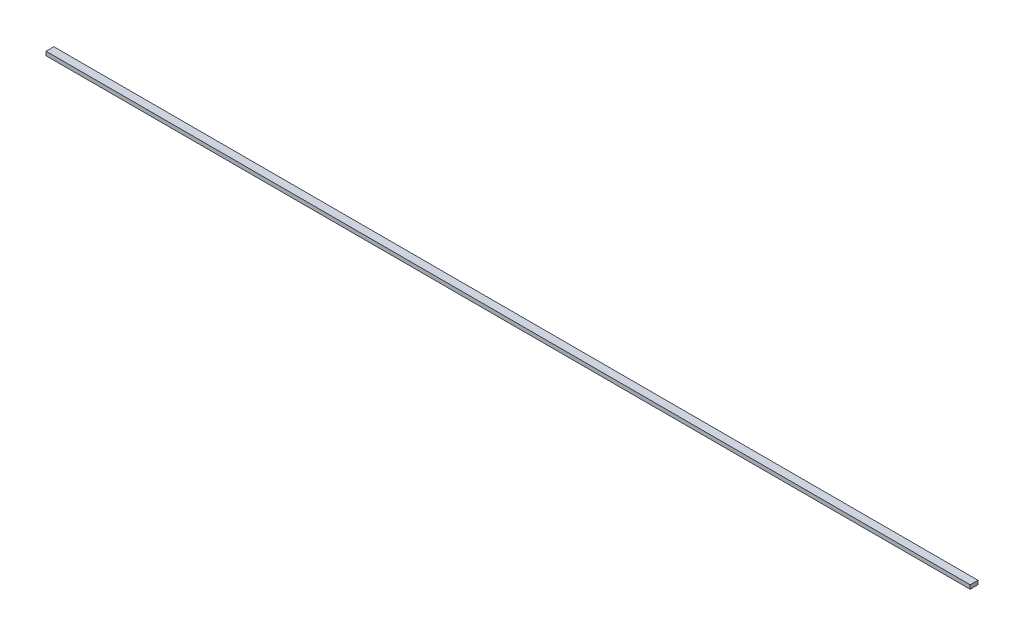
ISO-10303-21;
HEADER;
FILE_DESCRIPTION(('STEP AP214'),'2;1');
FILE_NAME('part.step','',(''),(''),'','','');
FILE_SCHEMA(('AUTOMOTIVE_DESIGN { 1 0 10303 214 1 1 1 1 }'));
ENDSEC;
DATA;
#1=APPLICATION_CONTEXT('core data for automotive mechanical design processes');
#2=APPLICATION_PROTOCOL_DEFINITION('international standard','automotive_design',2000,#1);
#3=PRODUCT_CONTEXT('',#1,'mechanical');
#4=PRODUCT('Part','Part','',(#3));
#5=PRODUCT_RELATED_PRODUCT_CATEGORY('part','',(#4));
#6=PRODUCT_DEFINITION_FORMATION('','',#4);
#7=PRODUCT_DEFINITION_CONTEXT('part definition',#1,'design');
#8=PRODUCT_DEFINITION('design','',#6,#7);
#9=PRODUCT_DEFINITION_SHAPE('','',#8);
#10=(LENGTH_UNIT() NAMED_UNIT(*) SI_UNIT(.MILLI.,.METRE.));
#11=(NAMED_UNIT(*) PLANE_ANGLE_UNIT() SI_UNIT($,.RADIAN.));
#12=(NAMED_UNIT(*) SI_UNIT($,.STERADIAN.) SOLID_ANGLE_UNIT());
#13=UNCERTAINTY_MEASURE_WITH_UNIT(LENGTH_MEASURE(1.E-05),#10,'distance_accuracy_value','');
#14=(GEOMETRIC_REPRESENTATION_CONTEXT(3) GLOBAL_UNCERTAINTY_ASSIGNED_CONTEXT((#13)) GLOBAL_UNIT_ASSIGNED_CONTEXT((#10,
#11,#12)) REPRESENTATION_CONTEXT('',''));
#15=CARTESIAN_POINT('',(0.,0.,0.));
#16=DIRECTION('',(0.,0.,1.));
#17=DIRECTION('',(1.,0.,0.));
#18=AXIS2_PLACEMENT_3D('',#15,#16,#17);
#19=CARTESIAN_POINT('',(-90.3330492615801,12.7,-18.5451955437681));
#20=DIRECTION('',(1.,0.,0.));
#21=DIRECTION('',(0.,0.,-1.));
#22=AXIS2_PLACEMENT_3D('',#19,#20,#21);
#23=PLANE('',#22);
#24=DIRECTION('',(0.,0.,1.));
#25=VECTOR('',#24,1.);
#26=CARTESIAN_POINT('',(-90.3330492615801,0.,-18.5451955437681));
#27=LINE('',#26,#25);
#28=CARTESIAN_POINT('',(-90.3330492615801,0.,-43.9451955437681));
#29=VERTEX_POINT('',#28);
#30=CARTESIAN_POINT('',(-90.3330492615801,0.,-18.5451955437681));
#31=VERTEX_POINT('',#30);
#32=EDGE_CURVE('E96',#29,#31,#27,.T.);
#33=ORIENTED_EDGE('',*,*,#32,.T.);
#34=DIRECTION('',(0.,-1.,0.));
#35=VECTOR('',#34,1.);
#36=CARTESIAN_POINT('',(-90.3330492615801,12.7,-18.5451955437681));
#37=LINE('',#36,#35);
#38=CARTESIAN_POINT('',(-90.3330492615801,12.7,-18.5451955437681));
#39=VERTEX_POINT('',#38);
#40=EDGE_CURVE('E11',#39,#31,#37,.T.);
#41=ORIENTED_EDGE('',*,*,#40,.F.);
#42=DIRECTION('',(0.,0.,1.));
#43=VECTOR('',#42,1.);
#44=CARTESIAN_POINT('',(-90.3330492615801,12.7,-18.5451955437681));
#45=LINE('',#44,#43);
#46=CARTESIAN_POINT('',(-90.3330492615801,12.7,-43.9451955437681));
#47=VERTEX_POINT('',#46);
#48=EDGE_CURVE('E84',#47,#39,#45,.T.);
#49=ORIENTED_EDGE('',*,*,#48,.F.);
#50=DIRECTION('',(0.,-1.,0.));
#51=VECTOR('',#50,1.);
#52=CARTESIAN_POINT('',(-90.3330492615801,12.7,-43.9451955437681));
#53=LINE('',#52,#51);
#54=EDGE_CURVE('E92',#47,#29,#53,.T.);
#55=ORIENTED_EDGE('',*,*,#54,.T.);
#56=EDGE_LOOP('',(#33,#41,#49,#55));
#57=FACE_BOUND('',#56,.T.);
#58=ADVANCED_FACE('F33',(#57),#23,.F.);
#59=CARTESIAN_POINT('',(-90.3330492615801,12.7,-18.5451955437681));
#60=DIRECTION('',(0.,0.,-1.));
#61=DIRECTION('',(-1.,0.,0.));
#62=AXIS2_PLACEMENT_3D('',#59,#60,#61);
#63=PLANE('',#62);
#64=DIRECTION('',(1.,0.,0.));
#65=VECTOR('',#64,1.);
#66=CARTESIAN_POINT('',(-90.3330492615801,0.,-18.5451955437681));
#67=LINE('',#66,#65);
#68=CARTESIAN_POINT('',(2906.86695073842,0.,-18.5451955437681));
#69=VERTEX_POINT('',#68);
#70=EDGE_CURVE('E88',#31,#69,#67,.T.);
#71=ORIENTED_EDGE('',*,*,#70,.T.);
#72=DIRECTION('',(0.,-1.,0.));
#73=VECTOR('',#72,1.);
#74=CARTESIAN_POINT('',(2906.86695073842,12.7,-18.5451955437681));
#75=LINE('',#74,#73);
#76=CARTESIAN_POINT('',(2906.86695073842,12.7,-18.5451955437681));
#77=VERTEX_POINT('',#76);
#78=EDGE_CURVE('E41',#77,#69,#75,.T.);
#79=ORIENTED_EDGE('',*,*,#78,.F.);
#80=DIRECTION('',(1.,0.,0.));
#81=VECTOR('',#80,1.);
#82=CARTESIAN_POINT('',(-90.3330492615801,12.7,-18.5451955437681));
#83=LINE('',#82,#81);
#84=EDGE_CURVE('E79',#39,#77,#83,.T.);
#85=ORIENTED_EDGE('',*,*,#84,.F.);
#86=ORIENTED_EDGE('',*,*,#40,.T.);
#87=EDGE_LOOP('',(#71,#79,#85,#86));
#88=FACE_BOUND('',#87,.T.);
#89=ADVANCED_FACE('F87',(#88),#63,.F.);
#90=CARTESIAN_POINT('',(2906.86695073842,12.7,-18.5451955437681));
#91=DIRECTION('',(-1.,0.,0.));
#92=DIRECTION('',(0.,0.,1.));
#93=AXIS2_PLACEMENT_3D('',#90,#91,#92);
#94=PLANE('',#93);
#95=DIRECTION('',(0.,0.,-1.));
#96=VECTOR('',#95,1.);
#97=CARTESIAN_POINT('',(2906.86695073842,0.,-18.5451955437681));
#98=LINE('',#97,#96);
#99=CARTESIAN_POINT('',(2906.86695073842,0.,-43.9451955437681));
#100=VERTEX_POINT('',#99);
#101=EDGE_CURVE('E66',#69,#100,#98,.T.);
#102=ORIENTED_EDGE('',*,*,#101,.T.);
#103=DIRECTION('',(0.,-1.,0.));
#104=VECTOR('',#103,1.);
#105=CARTESIAN_POINT('',(2906.86695073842,12.7,-43.9451955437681));
#106=LINE('',#105,#104);
#107=CARTESIAN_POINT('',(2906.86695073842,12.7,-43.9451955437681));
#108=VERTEX_POINT('',#107);
#109=EDGE_CURVE('E89',#108,#100,#106,.T.);
#110=ORIENTED_EDGE('',*,*,#109,.F.);
#111=DIRECTION('',(0.,0.,-1.));
#112=VECTOR('',#111,1.);
#113=CARTESIAN_POINT('',(2906.86695073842,12.7,-18.5451955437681));
#114=LINE('',#113,#112);
#115=EDGE_CURVE('E82',#77,#108,#114,.T.);
#116=ORIENTED_EDGE('',*,*,#115,.F.);
#117=ORIENTED_EDGE('',*,*,#78,.T.);
#118=EDGE_LOOP('',(#102,#110,#116,#117));
#119=FACE_BOUND('',#118,.T.);
#120=ADVANCED_FACE('F90',(#119),#94,.F.);
#121=CARTESIAN_POINT('',(-90.3330492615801,12.7,-43.9451955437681));
#122=DIRECTION('',(0.,0.,1.));
#123=DIRECTION('',(1.,0.,0.));
#124=AXIS2_PLACEMENT_3D('',#121,#122,#123);
#125=PLANE('',#124);
#126=DIRECTION('',(-1.,0.,0.));
#127=VECTOR('',#126,1.);
#128=CARTESIAN_POINT('',(-90.3330492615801,0.,-43.9451955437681));
#129=LINE('',#128,#127);
#130=EDGE_CURVE('E72',#100,#29,#129,.T.);
#131=ORIENTED_EDGE('',*,*,#130,.T.);
#132=ORIENTED_EDGE('',*,*,#54,.F.);
#133=DIRECTION('',(-1.,0.,0.));
#134=VECTOR('',#133,1.);
#135=CARTESIAN_POINT('',(-90.3330492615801,12.7,-43.9451955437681));
#136=LINE('',#135,#134);
#137=EDGE_CURVE('E49',#108,#47,#136,.T.);
#138=ORIENTED_EDGE('',*,*,#137,.F.);
#139=ORIENTED_EDGE('',*,*,#109,.T.);
#140=EDGE_LOOP('',(#131,#132,#138,#139));
#141=FACE_BOUND('',#140,.T.);
#142=ADVANCED_FACE('F103',(#141),#125,.F.);
#143=CARTESIAN_POINT('',(0.,12.7,0.));
#144=DIRECTION('',(0.,-1.,0.));
#145=DIRECTION('',(0.,0.,-1.));
#146=AXIS2_PLACEMENT_3D('',#143,#144,#145);
#147=PLANE('',#146);
#148=ORIENTED_EDGE('',*,*,#48,.T.);
#149=ORIENTED_EDGE('',*,*,#84,.T.);
#150=ORIENTED_EDGE('',*,*,#115,.T.);
#151=ORIENTED_EDGE('',*,*,#137,.T.);
#152=EDGE_LOOP('',(#148,#149,#150,#151));
#153=FACE_BOUND('',#152,.T.);
#154=ADVANCED_FACE('F80',(#153),#147,.F.);
#155=CARTESIAN_POINT('',(0.,0.,0.));
#156=DIRECTION('',(0.,-1.,0.));
#157=DIRECTION('',(0.,0.,-1.));
#158=AXIS2_PLACEMENT_3D('',#155,#156,#157);
#159=PLANE('',#158);
#160=ORIENTED_EDGE('',*,*,#32,.F.);
#161=ORIENTED_EDGE('',*,*,#130,.F.);
#162=ORIENTED_EDGE('',*,*,#101,.F.);
#163=ORIENTED_EDGE('',*,*,#70,.F.);
#164=EDGE_LOOP('',(#160,#161,#162,#163));
#165=FACE_BOUND('',#164,.T.);
#166=ADVANCED_FACE('F106',(#165),#159,.T.);
#167=CLOSED_SHELL('',(#58,#89,#120,#142,#154,#166));
#168=MANIFOLD_SOLID_BREP('B2',#167);
#169=ADVANCED_BREP_SHAPE_REPRESENTATION('',(#18,#168),#14);
#170=SHAPE_DEFINITION_REPRESENTATION(#9,#169);
ENDSEC;
END-ISO-10303-21;
